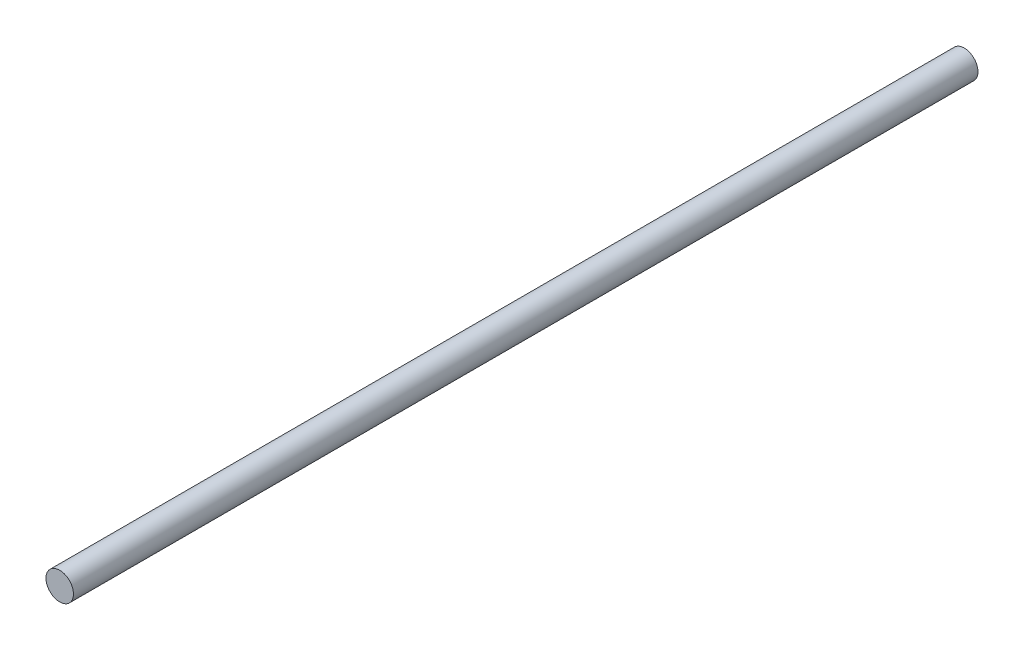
from build123d import *

# Parameters (mm, degrees)
SKETCH_1_R      = 3.175
EXTRUDE_1_DEPTH = 209


with BuildPart() as part:
    # Sketch 1 → Extrude 1 (new body)
    with BuildSketch(Plane.XY):
        Circle(SKETCH_1_R)
    extrude(amount=EXTRUDE_1_DEPTH)


solid = part.part
